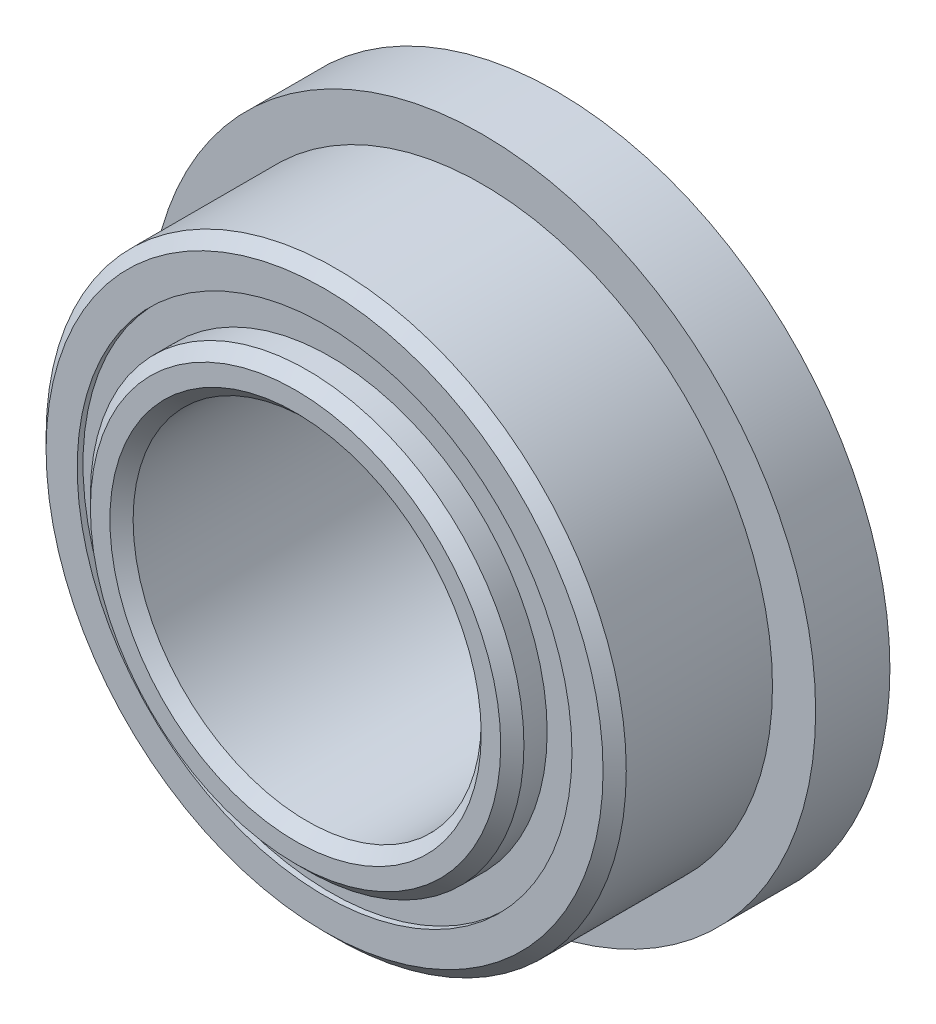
from build123d import *

# Parameters (mm, degrees)
CIRPATTERN1_COUNT = 10
SKETCH5_W         = 0.772168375
SKETCH5_H         = 0.418681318
SKETCH6_W         = 1.016
SKETCH6_H         = 1.174959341


with BuildPart() as part:
    # Sketch1 → Revolve1 (revolve)
    with BuildSketch(Plane(origin=(0, 0, 0), x_dir=(0, 0, -1), z_dir=(1, 0, 0)), mode=Mode.PRIVATE) as revolve1_sk:
        with BuildLine():
            Line((1.42875, 3.96875), (-1.42875, 3.96875))
            Line((-1.42875, 3.96875), (-1.5875, 3.81))
            Line((-1.5875, 3.81), (-1.5875, 3.384340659))
            Line((-1.5875, 3.384340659), (-0.705555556, 3.384340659))
            ThreePointArc((-0.705555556, 3.384340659), (0, 3.910956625), (0.705555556, 3.384340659))
            Line((0.705555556, 3.384340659), (1.5875, 3.384340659))
            Line((1.5875, 3.384340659), (1.5875, 3.81))
            Line((1.5875, 3.81), (1.42875, 3.96875))
        make_face()
    revolve(revolve1_sk.sketch.rotate(Axis((0, 0, 1.5875), (0, 0, -1)), 90), axis=Axis((0, 0, 1.5875), (0, 0, -1)))

    # Sketch6 → Revolve6 (revolve)
    with BuildSketch(Plane(origin=(0, 0, 0), x_dir=(0, 0, -1), z_dir=(1, 0, 0)), mode=Mode.PRIVATE) as revolve6_sk:
        with Locations((1.0795, 3.97182033)):
            Rectangle(SKETCH6_W, SKETCH6_H)
    revolve(revolve6_sk.sketch.rotate(Axis((0, 0, -1.5875), (0, 0, 1)), 270), axis=Axis((0, 0, -1.5875), (0, 0, 1)))


with BuildPart() as body_2:
    # Sketch3 → Revolve3 (revolve)
    with BuildSketch(Plane(origin=(0, 0, 0), x_dir=(0, 0, -1), z_dir=(1, 0, 0)), mode=Mode.PRIVATE) as revolve3_sk:
        with BuildLine():
            Line((-1.984375, 2.54), (-1.984375, 2.806909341))
            Line((-1.984375, 2.806909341), (-1.825625, 2.965659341))
            Line((-1.825625, 2.965659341), (-0.705555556, 2.965659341))
            ThreePointArc((-0.705555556, 2.965659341), (0, 2.439043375), (0.705555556, 2.965659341))
            Line((0.705555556, 2.965659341), (1.825625, 2.965659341))
            Line((1.825625, 2.965659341), (1.984375, 2.806909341))
            Line((1.984375, 2.806909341), (1.984375, 2.54))
            Line((1.984375, 2.54), (1.825625, 2.38125))
            Line((1.825625, 2.38125), (-1.825625, 2.38125))
            Line((-1.825625, 2.38125), (-1.984375, 2.54))
        make_face()
    revolve(revolve3_sk.sketch.rotate(Axis((0, 0, 1.5875), (0, 0, -1)), 90), axis=Axis((0, 0, 1.5875), (0, 0, -1)))


with BuildPart() as body_3:
    # Sketch4 → Revolve4 (revolve)
    with BuildSketch(Plane(origin=(0, 0, 0), x_dir=(0, 0, -1), z_dir=(1, 0, 0))):
        with BuildLine():
            Line((-0.735956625, 3.175), (0.735956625, 3.175))
            ThreePointArc((0.735956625, 3.175), (0, 3.910956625), (-0.735956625, 3.175))
        make_face()
    revolve(axis=Axis((0, 3.175, 0.735956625), (0, 0, -1)))


with BuildPart() as cirpattern1_1:
    # CirPattern1: pattern copy
    add(body_3.part.rotate(Axis((0, 0, 0), (0, 0, 1)), 1 * 360 / CIRPATTERN1_COUNT))


with BuildPart() as cirpattern1_2:
    # CirPattern1: pattern copy
    add(body_3.part.rotate(Axis((0, 0, 0), (0, 0, 1)), 2 * 360 / CIRPATTERN1_COUNT))


with BuildPart() as cirpattern1_3:
    # CirPattern1: pattern copy
    add(body_3.part.rotate(Axis((0, 0, 0), (0, 0, 1)), 3 * 360 / CIRPATTERN1_COUNT))


with BuildPart() as cirpattern1_4:
    # CirPattern1: pattern copy
    add(body_3.part.rotate(Axis((0, 0, 0), (0, 0, 1)), 4 * 360 / CIRPATTERN1_COUNT))


with BuildPart() as cirpattern1_5:
    # CirPattern1: pattern copy
    add(body_3.part.rotate(Axis((0, 0, 0), (0, 0, 1)), 5 * 360 / CIRPATTERN1_COUNT))


with BuildPart() as cirpattern1_6:
    # CirPattern1: pattern copy
    add(body_3.part.rotate(Axis((0, 0, 0), (0, 0, 1)), 6 * 360 / CIRPATTERN1_COUNT))


with BuildPart() as cirpattern1_7:
    # CirPattern1: pattern copy
    add(body_3.part.rotate(Axis((0, 0, 0), (0, 0, 1)), 7 * 360 / CIRPATTERN1_COUNT))


with BuildPart() as cirpattern1_8:
    # CirPattern1: pattern copy
    add(body_3.part.rotate(Axis((0, 0, 0), (0, 0, 1)), 8 * 360 / CIRPATTERN1_COUNT))


with BuildPart() as cirpattern1_9:
    # CirPattern1: pattern copy
    add(body_3.part.rotate(Axis((0, 0, 0), (0, 0, 1)), 9 * 360 / CIRPATTERN1_COUNT))


with BuildPart() as body_13:
    # Sketch5 → Revolve5 (revolve)
    with BuildSketch(Plane(origin=(0, 0, 0), x_dir=(0, 0, -1), z_dir=(1, 0, 0)), mode=Mode.PRIVATE) as revolve5_sk:
        with Locations((-1.122040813, 3.175)):
            Rectangle(SKETCH5_W, SKETCH5_H)
        with Locations((1.122040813, 3.175)):
            Rectangle(SKETCH5_W, SKETCH5_H)
    revolve(revolve5_sk.sketch.rotate(Axis((0, 0, 1.5875), (0, 0, -1)), 90), axis=Axis((0, 0, 1.5875), (0, 0, -1)))


solid = Compound([part.part, body_2.part, body_3.part, cirpattern1_1.part, cirpattern1_2.part, cirpattern1_3.part, cirpattern1_4.part, cirpattern1_5.part, cirpattern1_6.part, cirpattern1_7.part, cirpattern1_8.part, cirpattern1_9.part, body_13.part])
